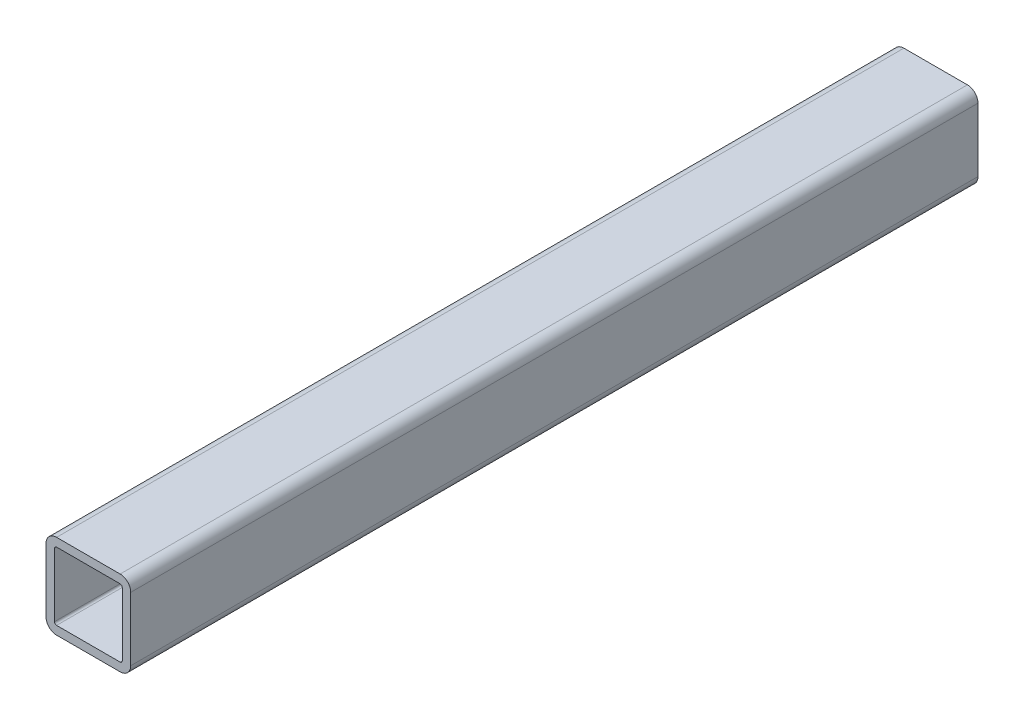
ISO-10303-21;
HEADER;
FILE_DESCRIPTION(('STEP AP214'),'2;1');
FILE_NAME('part.step','',(''),(''),'','','');
FILE_SCHEMA(('AUTOMOTIVE_DESIGN { 1 0 10303 214 1 1 1 1 }'));
ENDSEC;
DATA;
#1=APPLICATION_CONTEXT('core data for automotive mechanical design processes');
#2=APPLICATION_PROTOCOL_DEFINITION('international standard','automotive_design',2000,#1);
#3=PRODUCT_CONTEXT('',#1,'mechanical');
#4=PRODUCT('Part','Part','',(#3));
#5=PRODUCT_RELATED_PRODUCT_CATEGORY('part','',(#4));
#6=PRODUCT_DEFINITION_FORMATION('','',#4);
#7=PRODUCT_DEFINITION_CONTEXT('part definition',#1,'design');
#8=PRODUCT_DEFINITION('design','',#6,#7);
#9=PRODUCT_DEFINITION_SHAPE('','',#8);
#10=(LENGTH_UNIT() NAMED_UNIT(*) SI_UNIT(.MILLI.,.METRE.));
#11=(NAMED_UNIT(*) PLANE_ANGLE_UNIT() SI_UNIT($,.RADIAN.));
#12=(NAMED_UNIT(*) SI_UNIT($,.STERADIAN.) SOLID_ANGLE_UNIT());
#13=UNCERTAINTY_MEASURE_WITH_UNIT(LENGTH_MEASURE(1.E-05),#10,'distance_accuracy_value','');
#14=(GEOMETRIC_REPRESENTATION_CONTEXT(3) GLOBAL_UNCERTAINTY_ASSIGNED_CONTEXT((#13)) GLOBAL_UNIT_ASSIGNED_CONTEXT((#10,
#11,#12)) REPRESENTATION_CONTEXT('',''));
#15=CARTESIAN_POINT('',(0.,0.,0.));
#16=DIRECTION('',(0.,0.,1.));
#17=DIRECTION('',(1.,0.,0.));
#18=AXIS2_PLACEMENT_3D('',#15,#16,#17);
#19=CARTESIAN_POINT('',(35.,-35.,400.));
#20=DIRECTION('',(0.,0.,1.));
#21=DIRECTION('',(1.,0.,0.));
#22=AXIS2_PLACEMENT_3D('',#19,#20,#21);
#23=PLANE('',#22);
#24=CARTESIAN_POINT('',(35.,-35.,400.));
#25=DIRECTION('',(0.,0.,1.));
#26=DIRECTION('',(1.,0.,0.));
#27=AXIS2_PLACEMENT_3D('',#24,#25,#26);
#28=CIRCLE('',#27,5.);
#29=CARTESIAN_POINT('',(35.,-40.,400.));
#30=VERTEX_POINT('',#29);
#31=CARTESIAN_POINT('',(40.,-35.,400.));
#32=VERTEX_POINT('',#31);
#33=EDGE_CURVE('E222',#30,#32,#28,.T.);
#34=ORIENTED_EDGE('',*,*,#33,.T.);
#35=DIRECTION('',(0.,1.,0.));
#36=VECTOR('',#35,1.);
#37=CARTESIAN_POINT('',(40.,-5.00000000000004,400.));
#38=LINE('',#37,#36);
#39=CARTESIAN_POINT('',(40.,-5.00000000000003,400.));
#40=VERTEX_POINT('',#39);
#41=EDGE_CURVE('E225',#32,#40,#38,.T.);
#42=ORIENTED_EDGE('',*,*,#41,.T.);
#43=CARTESIAN_POINT('',(35.,-5.,400.));
#44=DIRECTION('',(0.,0.,1.));
#45=DIRECTION('',(-1.,0.,0.));
#46=AXIS2_PLACEMENT_3D('',#43,#44,#45);
#47=CIRCLE('',#46,5.);
#48=CARTESIAN_POINT('',(35.,0.,400.));
#49=VERTEX_POINT('',#48);
#50=EDGE_CURVE('E227',#40,#49,#47,.T.);
#51=ORIENTED_EDGE('',*,*,#50,.T.);
#52=DIRECTION('',(-1.,0.,0.));
#53=VECTOR('',#52,1.);
#54=CARTESIAN_POINT('',(5.00000000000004,0.,400.));
#55=LINE('',#54,#53);
#56=CARTESIAN_POINT('',(5.00000000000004,0.,400.));
#57=VERTEX_POINT('',#56);
#58=EDGE_CURVE('E229',#49,#57,#55,.T.);
#59=ORIENTED_EDGE('',*,*,#58,.T.);
#60=CARTESIAN_POINT('',(5.,-5.,400.));
#61=DIRECTION('',(0.,0.,1.));
#62=DIRECTION('',(1.,0.,0.));
#63=AXIS2_PLACEMENT_3D('',#60,#61,#62);
#64=CIRCLE('',#63,5.);
#65=CARTESIAN_POINT('',(0.,-5.00000000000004,400.));
#66=VERTEX_POINT('',#65);
#67=EDGE_CURVE('E231',#57,#66,#64,.T.);
#68=ORIENTED_EDGE('',*,*,#67,.T.);
#69=DIRECTION('',(0.,-1.,0.));
#70=VECTOR('',#69,1.);
#71=CARTESIAN_POINT('',(0.,-5.00000000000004,400.));
#72=LINE('',#71,#70);
#73=CARTESIAN_POINT('',(0.,-35.,400.));
#74=VERTEX_POINT('',#73);
#75=EDGE_CURVE('E233',#66,#74,#72,.T.);
#76=ORIENTED_EDGE('',*,*,#75,.T.);
#77=CARTESIAN_POINT('',(5.,-35.,400.));
#78=DIRECTION('',(0.,0.,1.));
#79=DIRECTION('',(1.,0.,0.));
#80=AXIS2_PLACEMENT_3D('',#77,#78,#79);
#81=CIRCLE('',#80,5.);
#82=CARTESIAN_POINT('',(5.00000000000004,-40.,400.));
#83=VERTEX_POINT('',#82);
#84=EDGE_CURVE('E235',#74,#83,#81,.T.);
#85=ORIENTED_EDGE('',*,*,#84,.T.);
#86=DIRECTION('',(1.,0.,0.));
#87=VECTOR('',#86,1.);
#88=CARTESIAN_POINT('',(5.00000000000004,-40.,400.));
#89=LINE('',#88,#87);
#90=EDGE_CURVE('E237',#83,#30,#89,.T.);
#91=ORIENTED_EDGE('',*,*,#90,.T.);
#92=EDGE_LOOP('',(#34,#42,#51,#59,#68,#76,#85,#91));
#93=FACE_BOUND('',#92,.T.);
#94=DIRECTION('',(0.,-1.,0.));
#95=VECTOR('',#94,1.);
#96=CARTESIAN_POINT('',(4.,-5.00000000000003,400.));
#97=LINE('',#96,#95);
#98=CARTESIAN_POINT('',(4.,-5.00000000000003,400.));
#99=VERTEX_POINT('',#98);
#100=CARTESIAN_POINT('',(4.,-35.,400.));
#101=VERTEX_POINT('',#100);
#102=EDGE_CURVE('E180',#99,#101,#97,.T.);
#103=ORIENTED_EDGE('',*,*,#102,.F.);
#104=CARTESIAN_POINT('',(5.,-5.,400.));
#105=DIRECTION('',(0.,0.,1.));
#106=DIRECTION('',(1.,0.,0.));
#107=AXIS2_PLACEMENT_3D('',#104,#105,#106);
#108=CIRCLE('',#107,0.999999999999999);
#109=CARTESIAN_POINT('',(5.00000000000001,-4.,400.));
#110=VERTEX_POINT('',#109);
#111=EDGE_CURVE('E157',#110,#99,#108,.T.);
#112=ORIENTED_EDGE('',*,*,#111,.F.);
#113=DIRECTION('',(-1.,0.,0.));
#114=VECTOR('',#113,1.);
#115=CARTESIAN_POINT('',(5.00000000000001,-4.,400.));
#116=LINE('',#115,#114);
#117=CARTESIAN_POINT('',(35.,-4.,400.));
#118=VERTEX_POINT('',#117);
#119=EDGE_CURVE('E192',#118,#110,#116,.T.);
#120=ORIENTED_EDGE('',*,*,#119,.F.);
#121=CARTESIAN_POINT('',(35.,-5.,400.));
#122=DIRECTION('',(0.,0.,1.));
#123=DIRECTION('',(-1.,0.,0.));
#124=AXIS2_PLACEMENT_3D('',#121,#122,#123);
#125=CIRCLE('',#124,1.);
#126=CARTESIAN_POINT('',(36.,-5.00000000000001,400.));
#127=VERTEX_POINT('',#126);
#128=EDGE_CURVE('E190',#127,#118,#125,.T.);
#129=ORIENTED_EDGE('',*,*,#128,.F.);
#130=DIRECTION('',(0.,1.,0.));
#131=VECTOR('',#130,1.);
#132=CARTESIAN_POINT('',(36.,-5.00000000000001,400.));
#133=LINE('',#132,#131);
#134=CARTESIAN_POINT('',(36.,-35.,400.));
#135=VERTEX_POINT('',#134);
#136=EDGE_CURVE('E188',#135,#127,#133,.T.);
#137=ORIENTED_EDGE('',*,*,#136,.F.);
#138=CARTESIAN_POINT('',(35.,-35.,400.));
#139=DIRECTION('',(0.,0.,1.));
#140=DIRECTION('',(1.,0.,0.));
#141=AXIS2_PLACEMENT_3D('',#138,#139,#140);
#142=CIRCLE('',#141,1.);
#143=CARTESIAN_POINT('',(35.,-36.,400.));
#144=VERTEX_POINT('',#143);
#145=EDGE_CURVE('E186',#144,#135,#142,.T.);
#146=ORIENTED_EDGE('',*,*,#145,.F.);
#147=DIRECTION('',(1.,0.,0.));
#148=VECTOR('',#147,1.);
#149=CARTESIAN_POINT('',(5.00000000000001,-36.,400.));
#150=LINE('',#149,#148);
#151=CARTESIAN_POINT('',(5.00000000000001,-36.,400.));
#152=VERTEX_POINT('',#151);
#153=EDGE_CURVE('E184',#152,#144,#150,.T.);
#154=ORIENTED_EDGE('',*,*,#153,.F.);
#155=CARTESIAN_POINT('',(5.,-35.,400.));
#156=DIRECTION('',(0.,0.,1.));
#157=DIRECTION('',(1.,0.,0.));
#158=AXIS2_PLACEMENT_3D('',#155,#156,#157);
#159=CIRCLE('',#158,1.);
#160=EDGE_CURVE('E182',#101,#152,#159,.T.);
#161=ORIENTED_EDGE('',*,*,#160,.F.);
#162=EDGE_LOOP('',(#103,#112,#120,#129,#137,#146,#154,#161));
#163=FACE_BOUND('',#162,.T.);
#164=ADVANCED_FACE('F29',(#93,#163),#23,.T.);
#165=CARTESIAN_POINT('',(35.,-35.,0.));
#166=DIRECTION('',(0.,0.,1.));
#167=DIRECTION('',(1.,0.,0.));
#168=AXIS2_PLACEMENT_3D('',#165,#166,#167);
#169=PLANE('',#168);
#170=CARTESIAN_POINT('',(35.,-35.,0.));
#171=DIRECTION('',(0.,0.,1.));
#172=DIRECTION('',(1.,0.,0.));
#173=AXIS2_PLACEMENT_3D('',#170,#171,#172);
#174=CIRCLE('',#173,5.);
#175=CARTESIAN_POINT('',(35.,-40.,0.));
#176=VERTEX_POINT('',#175);
#177=CARTESIAN_POINT('',(40.,-35.,0.));
#178=VERTEX_POINT('',#177);
#179=EDGE_CURVE('E158',#176,#178,#174,.T.);
#180=ORIENTED_EDGE('',*,*,#179,.F.);
#181=DIRECTION('',(1.,0.,0.));
#182=VECTOR('',#181,1.);
#183=CARTESIAN_POINT('',(5.00000000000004,-40.,0.));
#184=LINE('',#183,#182);
#185=CARTESIAN_POINT('',(5.00000000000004,-40.,0.));
#186=VERTEX_POINT('',#185);
#187=EDGE_CURVE('E220',#186,#176,#184,.T.);
#188=ORIENTED_EDGE('',*,*,#187,.F.);
#189=CARTESIAN_POINT('',(5.,-35.,0.));
#190=DIRECTION('',(0.,0.,1.));
#191=DIRECTION('',(1.,0.,0.));
#192=AXIS2_PLACEMENT_3D('',#189,#190,#191);
#193=CIRCLE('',#192,5.);
#194=CARTESIAN_POINT('',(0.,-35.,0.));
#195=VERTEX_POINT('',#194);
#196=EDGE_CURVE('E218',#195,#186,#193,.T.);
#197=ORIENTED_EDGE('',*,*,#196,.F.);
#198=DIRECTION('',(0.,-1.,0.));
#199=VECTOR('',#198,1.);
#200=CARTESIAN_POINT('',(0.,-5.00000000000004,0.));
#201=LINE('',#200,#199);
#202=CARTESIAN_POINT('',(0.,-5.00000000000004,0.));
#203=VERTEX_POINT('',#202);
#204=EDGE_CURVE('E216',#203,#195,#201,.T.);
#205=ORIENTED_EDGE('',*,*,#204,.F.);
#206=CARTESIAN_POINT('',(5.,-5.,0.));
#207=DIRECTION('',(0.,0.,1.));
#208=DIRECTION('',(1.,0.,0.));
#209=AXIS2_PLACEMENT_3D('',#206,#207,#208);
#210=CIRCLE('',#209,5.);
#211=CARTESIAN_POINT('',(5.00000000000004,0.,0.));
#212=VERTEX_POINT('',#211);
#213=EDGE_CURVE('E214',#212,#203,#210,.T.);
#214=ORIENTED_EDGE('',*,*,#213,.F.);
#215=DIRECTION('',(-1.,0.,0.));
#216=VECTOR('',#215,1.);
#217=CARTESIAN_POINT('',(5.00000000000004,0.,0.));
#218=LINE('',#217,#216);
#219=CARTESIAN_POINT('',(35.,0.,0.));
#220=VERTEX_POINT('',#219);
#221=EDGE_CURVE('E212',#220,#212,#218,.T.);
#222=ORIENTED_EDGE('',*,*,#221,.F.);
#223=CARTESIAN_POINT('',(35.,-5.,0.));
#224=DIRECTION('',(0.,0.,1.));
#225=DIRECTION('',(-1.,0.,0.));
#226=AXIS2_PLACEMENT_3D('',#223,#224,#225);
#227=CIRCLE('',#226,5.);
#228=CARTESIAN_POINT('',(40.,-5.00000000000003,0.));
#229=VERTEX_POINT('',#228);
#230=EDGE_CURVE('E210',#229,#220,#227,.T.);
#231=ORIENTED_EDGE('',*,*,#230,.F.);
#232=DIRECTION('',(0.,1.,0.));
#233=VECTOR('',#232,1.);
#234=CARTESIAN_POINT('',(40.,-5.00000000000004,0.));
#235=LINE('',#234,#233);
#236=EDGE_CURVE('E208',#178,#229,#235,.T.);
#237=ORIENTED_EDGE('',*,*,#236,.F.);
#238=EDGE_LOOP('',(#180,#188,#197,#205,#214,#222,#231,#237));
#239=FACE_BOUND('',#238,.T.);
#240=CARTESIAN_POINT('',(5.,-5.,0.));
#241=DIRECTION('',(0.,0.,1.));
#242=DIRECTION('',(1.,0.,0.));
#243=AXIS2_PLACEMENT_3D('',#240,#241,#242);
#244=CIRCLE('',#243,0.999999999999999);
#245=CARTESIAN_POINT('',(5.00000000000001,-4.,0.));
#246=VERTEX_POINT('',#245);
#247=CARTESIAN_POINT('',(4.,-5.00000000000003,0.));
#248=VERTEX_POINT('',#247);
#249=EDGE_CURVE('E52',#246,#248,#244,.T.);
#250=ORIENTED_EDGE('',*,*,#249,.T.);
#251=DIRECTION('',(0.,-1.,0.));
#252=VECTOR('',#251,1.);
#253=CARTESIAN_POINT('',(4.,-5.00000000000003,0.));
#254=LINE('',#253,#252);
#255=CARTESIAN_POINT('',(4.,-35.,0.));
#256=VERTEX_POINT('',#255);
#257=EDGE_CURVE('E144',#248,#256,#254,.T.);
#258=ORIENTED_EDGE('',*,*,#257,.T.);
#259=CARTESIAN_POINT('',(5.,-35.,0.));
#260=DIRECTION('',(0.,0.,1.));
#261=DIRECTION('',(1.,0.,0.));
#262=AXIS2_PLACEMENT_3D('',#259,#260,#261);
#263=CIRCLE('',#262,1.);
#264=CARTESIAN_POINT('',(5.00000000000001,-36.,0.));
#265=VERTEX_POINT('',#264);
#266=EDGE_CURVE('E153',#256,#265,#263,.T.);
#267=ORIENTED_EDGE('',*,*,#266,.T.);
#268=DIRECTION('',(1.,0.,0.));
#269=VECTOR('',#268,1.);
#270=CARTESIAN_POINT('',(5.00000000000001,-36.,0.));
#271=LINE('',#270,#269);
#272=CARTESIAN_POINT('',(35.,-36.,0.));
#273=VERTEX_POINT('',#272);
#274=EDGE_CURVE('E167',#265,#273,#271,.T.);
#275=ORIENTED_EDGE('',*,*,#274,.T.);
#276=CARTESIAN_POINT('',(35.,-35.,0.));
#277=DIRECTION('',(0.,0.,1.));
#278=DIRECTION('',(1.,0.,0.));
#279=AXIS2_PLACEMENT_3D('',#276,#277,#278);
#280=CIRCLE('',#279,1.);
#281=CARTESIAN_POINT('',(36.,-35.,0.));
#282=VERTEX_POINT('',#281);
#283=EDGE_CURVE('E170',#273,#282,#280,.T.);
#284=ORIENTED_EDGE('',*,*,#283,.T.);
#285=DIRECTION('',(0.,1.,0.));
#286=VECTOR('',#285,1.);
#287=CARTESIAN_POINT('',(36.,-5.00000000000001,0.));
#288=LINE('',#287,#286);
#289=CARTESIAN_POINT('',(36.,-5.00000000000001,0.));
#290=VERTEX_POINT('',#289);
#291=EDGE_CURVE('E173',#282,#290,#288,.T.);
#292=ORIENTED_EDGE('',*,*,#291,.T.);
#293=CARTESIAN_POINT('',(35.,-5.,0.));
#294=DIRECTION('',(0.,0.,1.));
#295=DIRECTION('',(-1.,0.,0.));
#296=AXIS2_PLACEMENT_3D('',#293,#294,#295);
#297=CIRCLE('',#296,1.);
#298=CARTESIAN_POINT('',(35.,-4.,0.));
#299=VERTEX_POINT('',#298);
#300=EDGE_CURVE('E176',#290,#299,#297,.T.);
#301=ORIENTED_EDGE('',*,*,#300,.T.);
#302=DIRECTION('',(-1.,0.,0.));
#303=VECTOR('',#302,1.);
#304=CARTESIAN_POINT('',(5.00000000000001,-4.,0.));
#305=LINE('',#304,#303);
#306=EDGE_CURVE('E163',#299,#246,#305,.T.);
#307=ORIENTED_EDGE('',*,*,#306,.T.);
#308=EDGE_LOOP('',(#250,#258,#267,#275,#284,#292,#301,#307));
#309=FACE_BOUND('',#308,.T.);
#310=ADVANCED_FACE('F161',(#239,#309),#169,.F.);
#311=CARTESIAN_POINT('',(35.,-35.,400.));
#312=DIRECTION('',(0.,0.,-1.));
#313=DIRECTION('',(-1.,0.,0.));
#314=AXIS2_PLACEMENT_3D('',#311,#312,#313);
#315=CYLINDRICAL_SURFACE('',#314,5.);
#316=ORIENTED_EDGE('',*,*,#179,.T.);
#317=DIRECTION('',(0.,0.,-1.));
#318=VECTOR('',#317,1.);
#319=CARTESIAN_POINT('',(40.,-35.,400.));
#320=LINE('',#319,#318);
#321=EDGE_CURVE('E11',#32,#178,#320,.T.);
#322=ORIENTED_EDGE('',*,*,#321,.F.);
#323=ORIENTED_EDGE('',*,*,#33,.F.);
#324=DIRECTION('',(0.,0.,-1.));
#325=VECTOR('',#324,1.);
#326=CARTESIAN_POINT('',(35.,-40.,400.));
#327=LINE('',#326,#325);
#328=EDGE_CURVE('E239',#30,#176,#327,.T.);
#329=ORIENTED_EDGE('',*,*,#328,.T.);
#330=EDGE_LOOP('',(#316,#322,#323,#329));
#331=FACE_BOUND('',#330,.T.);
#332=ADVANCED_FACE('F31',(#331),#315,.T.);
#333=CARTESIAN_POINT('',(40.,-5.00000000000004,400.));
#334=DIRECTION('',(-1.,0.,0.));
#335=DIRECTION('',(0.,0.,1.));
#336=AXIS2_PLACEMENT_3D('',#333,#334,#335);
#337=PLANE('',#336);
#338=ORIENTED_EDGE('',*,*,#236,.T.);
#339=DIRECTION('',(0.,0.,-1.));
#340=VECTOR('',#339,1.);
#341=CARTESIAN_POINT('',(40.,-5.00000000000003,400.));
#342=LINE('',#341,#340);
#343=EDGE_CURVE('E37',#40,#229,#342,.T.);
#344=ORIENTED_EDGE('',*,*,#343,.F.);
#345=ORIENTED_EDGE('',*,*,#41,.F.);
#346=ORIENTED_EDGE('',*,*,#321,.T.);
#347=EDGE_LOOP('',(#338,#344,#345,#346));
#348=FACE_BOUND('',#347,.T.);
#349=ADVANCED_FACE('F283',(#348),#337,.F.);
#350=CARTESIAN_POINT('',(35.,-5.,400.));
#351=DIRECTION('',(0.,0.,-1.));
#352=DIRECTION('',(-1.,0.,0.));
#353=AXIS2_PLACEMENT_3D('',#350,#351,#352);
#354=CYLINDRICAL_SURFACE('',#353,5.);
#355=ORIENTED_EDGE('',*,*,#230,.T.);
#356=DIRECTION('',(0.,0.,-1.));
#357=VECTOR('',#356,1.);
#358=CARTESIAN_POINT('',(35.,0.,400.));
#359=LINE('',#358,#357);
#360=EDGE_CURVE('E254',#49,#220,#359,.T.);
#361=ORIENTED_EDGE('',*,*,#360,.F.);
#362=ORIENTED_EDGE('',*,*,#50,.F.);
#363=ORIENTED_EDGE('',*,*,#343,.T.);
#364=EDGE_LOOP('',(#355,#361,#362,#363));
#365=FACE_BOUND('',#364,.T.);
#366=ADVANCED_FACE('F261',(#365),#354,.T.);
#367=CARTESIAN_POINT('',(5.00000000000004,0.,400.));
#368=DIRECTION('',(0.,-1.,0.));
#369=DIRECTION('',(0.,0.,-1.));
#370=AXIS2_PLACEMENT_3D('',#367,#368,#369);
#371=PLANE('',#370);
#372=ORIENTED_EDGE('',*,*,#221,.T.);
#373=DIRECTION('',(0.,0.,-1.));
#374=VECTOR('',#373,1.);
#375=CARTESIAN_POINT('',(5.00000000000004,0.,400.));
#376=LINE('',#375,#374);
#377=EDGE_CURVE('E251',#57,#212,#376,.T.);
#378=ORIENTED_EDGE('',*,*,#377,.F.);
#379=ORIENTED_EDGE('',*,*,#58,.F.);
#380=ORIENTED_EDGE('',*,*,#360,.T.);
#381=EDGE_LOOP('',(#372,#378,#379,#380));
#382=FACE_BOUND('',#381,.T.);
#383=ADVANCED_FACE('F271',(#382),#371,.F.);
#384=CARTESIAN_POINT('',(5.,-5.,400.));
#385=DIRECTION('',(0.,0.,-1.));
#386=DIRECTION('',(-1.,0.,0.));
#387=AXIS2_PLACEMENT_3D('',#384,#385,#386);
#388=CYLINDRICAL_SURFACE('',#387,5.);
#389=ORIENTED_EDGE('',*,*,#213,.T.);
#390=DIRECTION('',(0.,0.,-1.));
#391=VECTOR('',#390,1.);
#392=CARTESIAN_POINT('',(0.,-5.00000000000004,400.));
#393=LINE('',#392,#391);
#394=EDGE_CURVE('E248',#66,#203,#393,.T.);
#395=ORIENTED_EDGE('',*,*,#394,.F.);
#396=ORIENTED_EDGE('',*,*,#67,.F.);
#397=ORIENTED_EDGE('',*,*,#377,.T.);
#398=EDGE_LOOP('',(#389,#395,#396,#397));
#399=FACE_BOUND('',#398,.T.);
#400=ADVANCED_FACE('F275',(#399),#388,.T.);
#401=CARTESIAN_POINT('',(0.,-5.00000000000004,400.));
#402=DIRECTION('',(1.,0.,0.));
#403=DIRECTION('',(0.,1.,0.));
#404=AXIS2_PLACEMENT_3D('',#401,#402,#403);
#405=PLANE('',#404);
#406=ORIENTED_EDGE('',*,*,#204,.T.);
#407=DIRECTION('',(0.,0.,-1.));
#408=VECTOR('',#407,1.);
#409=CARTESIAN_POINT('',(0.,-35.,400.));
#410=LINE('',#409,#408);
#411=EDGE_CURVE('E245',#74,#195,#410,.T.);
#412=ORIENTED_EDGE('',*,*,#411,.F.);
#413=ORIENTED_EDGE('',*,*,#75,.F.);
#414=ORIENTED_EDGE('',*,*,#394,.T.);
#415=EDGE_LOOP('',(#406,#412,#413,#414));
#416=FACE_BOUND('',#415,.T.);
#417=ADVANCED_FACE('F296',(#416),#405,.F.);
#418=CARTESIAN_POINT('',(5.,-35.,400.));
#419=DIRECTION('',(0.,0.,-1.));
#420=DIRECTION('',(-1.,0.,0.));
#421=AXIS2_PLACEMENT_3D('',#418,#419,#420);
#422=CYLINDRICAL_SURFACE('',#421,5.);
#423=ORIENTED_EDGE('',*,*,#196,.T.);
#424=DIRECTION('',(0.,0.,-1.));
#425=VECTOR('',#424,1.);
#426=CARTESIAN_POINT('',(5.00000000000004,-40.,400.));
#427=LINE('',#426,#425);
#428=EDGE_CURVE('E242',#83,#186,#427,.T.);
#429=ORIENTED_EDGE('',*,*,#428,.F.);
#430=ORIENTED_EDGE('',*,*,#84,.F.);
#431=ORIENTED_EDGE('',*,*,#411,.T.);
#432=EDGE_LOOP('',(#423,#429,#430,#431));
#433=FACE_BOUND('',#432,.T.);
#434=ADVANCED_FACE('F294',(#433),#422,.T.);
#435=CARTESIAN_POINT('',(5.00000000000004,-40.,400.));
#436=DIRECTION('',(0.,1.,0.));
#437=DIRECTION('',(0.,0.,1.));
#438=AXIS2_PLACEMENT_3D('',#435,#436,#437);
#439=PLANE('',#438);
#440=ORIENTED_EDGE('',*,*,#187,.T.);
#441=ORIENTED_EDGE('',*,*,#328,.F.);
#442=ORIENTED_EDGE('',*,*,#90,.F.);
#443=ORIENTED_EDGE('',*,*,#428,.T.);
#444=EDGE_LOOP('',(#440,#441,#442,#443));
#445=FACE_BOUND('',#444,.T.);
#446=ADVANCED_FACE('F289',(#445),#439,.F.);
#447=CARTESIAN_POINT('',(5.,-5.,400.));
#448=DIRECTION('',(0.,0.,-1.));
#449=DIRECTION('',(-1.,0.,0.));
#450=AXIS2_PLACEMENT_3D('',#447,#448,#449);
#451=CYLINDRICAL_SURFACE('',#450,0.999999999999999);
#452=ORIENTED_EDGE('',*,*,#249,.F.);
#453=DIRECTION('',(0.,0.,-1.));
#454=VECTOR('',#453,1.);
#455=CARTESIAN_POINT('',(5.00000000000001,-4.,400.));
#456=LINE('',#455,#454);
#457=EDGE_CURVE('E194',#110,#246,#456,.T.);
#458=ORIENTED_EDGE('',*,*,#457,.F.);
#459=ORIENTED_EDGE('',*,*,#111,.T.);
#460=DIRECTION('',(0.,0.,-1.));
#461=VECTOR('',#460,1.);
#462=CARTESIAN_POINT('',(4.,-5.00000000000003,400.));
#463=LINE('',#462,#461);
#464=EDGE_CURVE('E146',#99,#248,#463,.T.);
#465=ORIENTED_EDGE('',*,*,#464,.T.);
#466=EDGE_LOOP('',(#452,#458,#459,#465));
#467=FACE_BOUND('',#466,.T.);
#468=ADVANCED_FACE('F155',(#467),#451,.F.);
#469=CARTESIAN_POINT('',(4.,-5.00000000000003,400.));
#470=DIRECTION('',(1.,0.,0.));
#471=DIRECTION('',(0.,1.,0.));
#472=AXIS2_PLACEMENT_3D('',#469,#470,#471);
#473=PLANE('',#472);
#474=ORIENTED_EDGE('',*,*,#257,.F.);
#475=ORIENTED_EDGE('',*,*,#464,.F.);
#476=ORIENTED_EDGE('',*,*,#102,.T.);
#477=DIRECTION('',(0.,0.,-1.));
#478=VECTOR('',#477,1.);
#479=CARTESIAN_POINT('',(4.,-35.,400.));
#480=LINE('',#479,#478);
#481=EDGE_CURVE('E149',#101,#256,#480,.T.);
#482=ORIENTED_EDGE('',*,*,#481,.T.);
#483=EDGE_LOOP('',(#474,#475,#476,#482));
#484=FACE_BOUND('',#483,.T.);
#485=ADVANCED_FACE('F145',(#484),#473,.T.);
#486=CARTESIAN_POINT('',(5.,-35.,400.));
#487=DIRECTION('',(0.,0.,-1.));
#488=DIRECTION('',(-1.,0.,0.));
#489=AXIS2_PLACEMENT_3D('',#486,#487,#488);
#490=CYLINDRICAL_SURFACE('',#489,1.);
#491=ORIENTED_EDGE('',*,*,#266,.F.);
#492=ORIENTED_EDGE('',*,*,#481,.F.);
#493=ORIENTED_EDGE('',*,*,#160,.T.);
#494=DIRECTION('',(0.,0.,-1.));
#495=VECTOR('',#494,1.);
#496=CARTESIAN_POINT('',(5.00000000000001,-36.,400.));
#497=LINE('',#496,#495);
#498=EDGE_CURVE('E203',#152,#265,#497,.T.);
#499=ORIENTED_EDGE('',*,*,#498,.T.);
#500=EDGE_LOOP('',(#491,#492,#493,#499));
#501=FACE_BOUND('',#500,.T.);
#502=ADVANCED_FACE('F320',(#501),#490,.F.);
#503=CARTESIAN_POINT('',(5.00000000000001,-36.,400.));
#504=DIRECTION('',(0.,1.,0.));
#505=DIRECTION('',(0.,0.,1.));
#506=AXIS2_PLACEMENT_3D('',#503,#504,#505);
#507=PLANE('',#506);
#508=ORIENTED_EDGE('',*,*,#274,.F.);
#509=ORIENTED_EDGE('',*,*,#498,.F.);
#510=ORIENTED_EDGE('',*,*,#153,.T.);
#511=DIRECTION('',(0.,0.,-1.));
#512=VECTOR('',#511,1.);
#513=CARTESIAN_POINT('',(35.,-36.,400.));
#514=LINE('',#513,#512);
#515=EDGE_CURVE('E201',#144,#273,#514,.T.);
#516=ORIENTED_EDGE('',*,*,#515,.T.);
#517=EDGE_LOOP('',(#508,#509,#510,#516));
#518=FACE_BOUND('',#517,.T.);
#519=ADVANCED_FACE('F325',(#518),#507,.T.);
#520=CARTESIAN_POINT('',(35.,-35.,400.));
#521=DIRECTION('',(0.,0.,-1.));
#522=DIRECTION('',(-1.,0.,0.));
#523=AXIS2_PLACEMENT_3D('',#520,#521,#522);
#524=CYLINDRICAL_SURFACE('',#523,1.);
#525=ORIENTED_EDGE('',*,*,#283,.F.);
#526=ORIENTED_EDGE('',*,*,#515,.F.);
#527=ORIENTED_EDGE('',*,*,#145,.T.);
#528=DIRECTION('',(0.,0.,-1.));
#529=VECTOR('',#528,1.);
#530=CARTESIAN_POINT('',(36.,-35.,400.));
#531=LINE('',#530,#529);
#532=EDGE_CURVE('E199',#135,#282,#531,.T.);
#533=ORIENTED_EDGE('',*,*,#532,.T.);
#534=EDGE_LOOP('',(#525,#526,#527,#533));
#535=FACE_BOUND('',#534,.T.);
#536=ADVANCED_FACE('F329',(#535),#524,.F.);
#537=CARTESIAN_POINT('',(36.,-5.00000000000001,400.));
#538=DIRECTION('',(-1.,0.,0.));
#539=DIRECTION('',(0.,0.,1.));
#540=AXIS2_PLACEMENT_3D('',#537,#538,#539);
#541=PLANE('',#540);
#542=ORIENTED_EDGE('',*,*,#291,.F.);
#543=ORIENTED_EDGE('',*,*,#532,.F.);
#544=ORIENTED_EDGE('',*,*,#136,.T.);
#545=DIRECTION('',(0.,0.,-1.));
#546=VECTOR('',#545,1.);
#547=CARTESIAN_POINT('',(36.,-5.00000000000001,400.));
#548=LINE('',#547,#546);
#549=EDGE_CURVE('E197',#127,#290,#548,.T.);
#550=ORIENTED_EDGE('',*,*,#549,.T.);
#551=EDGE_LOOP('',(#542,#543,#544,#550));
#552=FACE_BOUND('',#551,.T.);
#553=ADVANCED_FACE('F333',(#552),#541,.T.);
#554=CARTESIAN_POINT('',(35.,-5.,400.));
#555=DIRECTION('',(0.,0.,-1.));
#556=DIRECTION('',(-1.,0.,0.));
#557=AXIS2_PLACEMENT_3D('',#554,#555,#556);
#558=CYLINDRICAL_SURFACE('',#557,1.);
#559=ORIENTED_EDGE('',*,*,#300,.F.);
#560=ORIENTED_EDGE('',*,*,#549,.F.);
#561=ORIENTED_EDGE('',*,*,#128,.T.);
#562=DIRECTION('',(0.,0.,-1.));
#563=VECTOR('',#562,1.);
#564=CARTESIAN_POINT('',(35.,-4.,400.));
#565=LINE('',#564,#563);
#566=EDGE_CURVE('E44',#118,#299,#565,.T.);
#567=ORIENTED_EDGE('',*,*,#566,.T.);
#568=EDGE_LOOP('',(#559,#560,#561,#567));
#569=FACE_BOUND('',#568,.T.);
#570=ADVANCED_FACE('F337',(#569),#558,.F.);
#571=CARTESIAN_POINT('',(5.00000000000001,-4.,400.));
#572=DIRECTION('',(0.,-1.,0.));
#573=DIRECTION('',(0.,0.,-1.));
#574=AXIS2_PLACEMENT_3D('',#571,#572,#573);
#575=PLANE('',#574);
#576=ORIENTED_EDGE('',*,*,#306,.F.);
#577=ORIENTED_EDGE('',*,*,#566,.F.);
#578=ORIENTED_EDGE('',*,*,#119,.T.);
#579=ORIENTED_EDGE('',*,*,#457,.T.);
#580=EDGE_LOOP('',(#576,#577,#578,#579));
#581=FACE_BOUND('',#580,.T.);
#582=ADVANCED_FACE('F341',(#581),#575,.T.);
#583=CLOSED_SHELL('',(#164,#310,#332,#349,#366,#383,#400,#417,#434,#446,#468,#485,#502,#519,
#536,#553,#570,#582));
#584=MANIFOLD_SOLID_BREP('B2',#583);
#585=ADVANCED_BREP_SHAPE_REPRESENTATION('',(#18,#584),#14);
#586=SHAPE_DEFINITION_REPRESENTATION(#9,#585);
ENDSEC;
END-ISO-10303-21;
